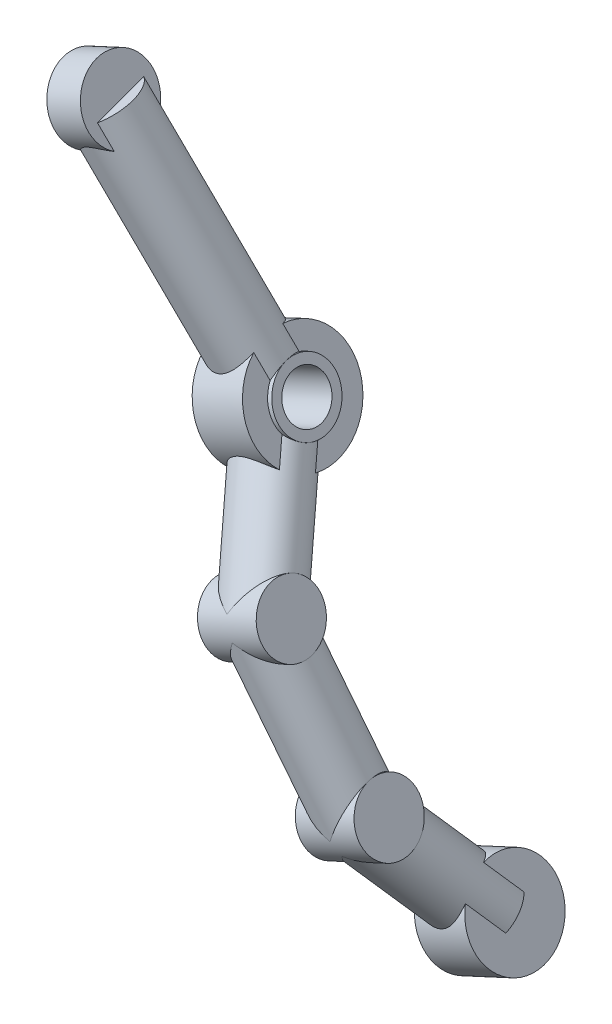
ISO-10303-21;
HEADER;
FILE_DESCRIPTION(('STEP AP214'),'2;1');
FILE_NAME('part.step','',(''),(''),'','','');
FILE_SCHEMA(('AUTOMOTIVE_DESIGN { 1 0 10303 214 1 1 1 1 }'));
ENDSEC;
DATA;
#1=APPLICATION_CONTEXT('core data for automotive mechanical design processes');
#2=APPLICATION_PROTOCOL_DEFINITION('international standard','automotive_design',2000,#1);
#3=PRODUCT_CONTEXT('',#1,'mechanical');
#4=PRODUCT('Part','Part','',(#3));
#5=PRODUCT_RELATED_PRODUCT_CATEGORY('part','',(#4));
#6=PRODUCT_DEFINITION_FORMATION('','',#4);
#7=PRODUCT_DEFINITION_CONTEXT('part definition',#1,'design');
#8=PRODUCT_DEFINITION('design','',#6,#7);
#9=PRODUCT_DEFINITION_SHAPE('','',#8);
#10=(LENGTH_UNIT() NAMED_UNIT(*) SI_UNIT(.MILLI.,.METRE.));
#11=(NAMED_UNIT(*) PLANE_ANGLE_UNIT() SI_UNIT($,.RADIAN.));
#12=(NAMED_UNIT(*) SI_UNIT($,.STERADIAN.) SOLID_ANGLE_UNIT());
#13=UNCERTAINTY_MEASURE_WITH_UNIT(LENGTH_MEASURE(1.E-05),#10,'distance_accuracy_value','');
#14=(GEOMETRIC_REPRESENTATION_CONTEXT(3) GLOBAL_UNCERTAINTY_ASSIGNED_CONTEXT((#13)) GLOBAL_UNIT_ASSIGNED_CONTEXT((#10,
#11,#12)) REPRESENTATION_CONTEXT('',''));
#15=CARTESIAN_POINT('',(0.,0.,0.));
#16=DIRECTION('',(0.,0.,1.));
#17=DIRECTION('',(1.,0.,0.));
#18=AXIS2_PLACEMENT_3D('',#15,#16,#17);
#19=CARTESIAN_POINT('',(455.341566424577,345.362620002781,22.));
#20=DIRECTION('',(0.336774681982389,-0.725660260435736,-0.600000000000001));
#21=DIRECTION('',(0.,0.637223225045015,-0.77067928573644));
#22=AXIS2_PLACEMENT_3D('',#19,#20,#21);
#23=PLANE('',#22);
#24=CARTESIAN_POINT('',(455.341566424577,345.362620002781,22.));
#25=DIRECTION('',(0.336774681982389,-0.725660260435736,-0.600000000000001));
#26=DIRECTION('',(0.,0.637223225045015,-0.77067928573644));
#27=AXIS2_PLACEMENT_3D('',#24,#25,#26);
#28=CIRCLE('',#27,3.50000000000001);
#29=CARTESIAN_POINT('',(453.075687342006,343.118562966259,23.4422205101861));
#30=VERTEX_POINT('',#29);
#31=CARTESIAN_POINT('',(452.164993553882,345.080866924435,20.5577794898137));
#32=VERTEX_POINT('',#31);
#33=EDGE_CURVE('E276',#30,#32,#28,.T.);
#34=ORIENTED_EDGE('',*,*,#33,.T.);
#35=DIRECTION('',(0.252581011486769,-0.544245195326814,0.799999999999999));
#36=VECTOR('',#35,1.);
#37=CARTESIAN_POINT('',(452.620340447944,344.099714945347,21.9999999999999));
#38=LINE('',#37,#36);
#39=EDGE_CURVE('E301',#32,#30,#38,.T.);
#40=ORIENTED_EDGE('',*,*,#39,.T.);
#41=EDGE_LOOP('',(#34,#40));
#42=FACE_BOUND('',#41,.T.);
#43=ADVANCED_FACE('F100',(#42),#23,.T.);
#44=CARTESIAN_POINT('',(450.289946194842,356.247523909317,31.));
#45=DIRECTION('',(0.336774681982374,-0.725660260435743,-0.600000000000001));
#46=DIRECTION('',(0.,0.637223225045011,-0.770679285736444));
#47=AXIS2_PLACEMENT_3D('',#44,#45,#46);
#48=CYLINDRICAL_SURFACE('',#47,3.50000000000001);
#49=CARTESIAN_POINT('',(450.289946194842,356.247523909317,31.));
#50=DIRECTION('',(0.879534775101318,-0.215449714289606,-0.42426406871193));
#51=DIRECTION('',(-0.403263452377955,-0.810788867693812,-0.424264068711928));
#52=AXIS2_PLACEMENT_3D('',#49,#50,#51);
#53=ELLIPSE('',#52,4.94974746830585,3.50000000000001);
#54=CARTESIAN_POINT('',(448.958208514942,357.147420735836,27.7822113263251));
#55=VERTEX_POINT('',#54);
#56=CARTESIAN_POINT('',(448.293893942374,352.234323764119,28.9));
#57=VERTEX_POINT('',#56);
#58=EDGE_CURVE('E514',#55,#57,#53,.F.);
#59=ORIENTED_EDGE('',*,*,#58,.F.);
#60=CARTESIAN_POINT('',(450.289946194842,356.247523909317,31.));
#61=DIRECTION('',(0.387024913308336,-0.833936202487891,-0.393398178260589));
#62=DIRECTION('',(0.165608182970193,-0.356841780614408,0.919368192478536));
#63=AXIS2_PLACEMENT_3D('',#60,#61,#62);
#64=ELLIPSE('',#63,3.60255219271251,3.50000000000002);
#65=CARTESIAN_POINT('',(450.46242659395,357.845519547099,27.7822113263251));
#66=VERTEX_POINT('',#65);
#67=EDGE_CURVE('E491',#55,#66,#64,.T.);
#68=ORIENTED_EDGE('',*,*,#67,.T.);
#69=CARTESIAN_POINT('',(450.289946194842,356.247523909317,31.));
#70=DIRECTION('',(-0.403263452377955,-0.810788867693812,-0.424264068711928));
#71=DIRECTION('',(0.879534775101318,-0.215449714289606,-0.42426406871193));
#72=AXIS2_PLACEMENT_3D('',#69,#70,#71);
#73=ELLIPSE('',#72,4.94974746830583,3.50000000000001);
#74=CARTESIAN_POINT('',(454.643421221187,355.181102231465,28.9));
#75=VERTEX_POINT('',#74);
#76=EDGE_CURVE('E507',#75,#66,#73,.F.);
#77=ORIENTED_EDGE('',*,*,#76,.F.);
#78=CARTESIAN_POINT('',(451.173979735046,354.342665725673,33.8));
#79=VERTEX_POINT('',#78);
#80=EDGE_CURVE('E510',#79,#75,#73,.F.);
#81=ORIENTED_EDGE('',*,*,#80,.F.);
#82=EDGE_CURVE('E511',#57,#79,#53,.F.);
#83=ORIENTED_EDGE('',*,*,#82,.F.);
#84=EDGE_LOOP('',(#59,#68,#77,#81,#83));
#85=FACE_BOUND('',#84,.T.);
#86=CARTESIAN_POINT('',(450.594380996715,348.465121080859,23.3559932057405));
#87=CARTESIAN_POINT('',(450.632576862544,348.511820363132,23.262758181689));
#88=CARTESIAN_POINT('',(450.67554446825,348.557084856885,23.1708172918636));
#89=CARTESIAN_POINT('',(450.770262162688,348.645066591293,22.9903806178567));
#90=CARTESIAN_POINT('',(450.82200674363,348.687785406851,22.9018827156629));
#91=CARTESIAN_POINT('',(450.933897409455,348.771302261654,22.7285584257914));
#92=CARTESIAN_POINT('',(450.994091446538,348.812087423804,22.6437568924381));
#93=CARTESIAN_POINT('',(451.122005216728,348.891957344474,22.479161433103));
#94=CARTESIAN_POINT('',(451.189726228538,348.931041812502,22.3993683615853));
#95=CARTESIAN_POINT('',(451.332017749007,349.008023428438,22.2457518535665));
#96=CARTESIAN_POINT('',(451.406577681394,349.045922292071,22.1719195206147));
#97=CARTESIAN_POINT('',(451.562054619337,349.121234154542,22.0310791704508));
#98=CARTESIAN_POINT('',(451.642972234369,349.158647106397,21.9640718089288));
#99=CARTESIAN_POINT('',(451.894135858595,349.271072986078,21.7752716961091));
#100=CARTESIAN_POINT('',(452.07337641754,349.346572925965,21.6650616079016));
#101=CARTESIAN_POINT('',(452.389193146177,349.479216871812,21.5162609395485));
#102=CARTESIAN_POINT('',(452.521095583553,349.534515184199,21.466038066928));
#103=CARTESIAN_POINT('',(452.789799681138,349.649545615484,21.3898051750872));
#104=CARTESIAN_POINT('',(452.926591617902,349.709269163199,21.3637496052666));
#105=CARTESIAN_POINT('',(453.201493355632,349.833228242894,21.3385991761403));
#106=CARTESIAN_POINT('',(453.339606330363,349.897484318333,21.3396361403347));
#107=CARTESIAN_POINT('',(453.611969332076,350.028075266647,21.3688613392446));
#108=CARTESIAN_POINT('',(453.746215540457,350.094412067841,21.3970755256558));
#109=CARTESIAN_POINT('',(454.029276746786,350.236646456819,21.4841844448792));
#110=CARTESIAN_POINT('',(454.176862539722,350.312324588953,21.5473576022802));
#111=CARTESIAN_POINT('',(454.461584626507,350.457141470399,21.699752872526));
#112=CARTESIAN_POINT('',(454.598692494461,350.526262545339,21.7890428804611));
#113=CARTESIAN_POINT('',(454.898965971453,350.671170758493,22.0149625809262));
#114=CARTESIAN_POINT('',(455.059011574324,350.743616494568,22.1578608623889));
#115=CARTESIAN_POINT('',(455.364188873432,350.863859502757,22.4674356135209));
#116=CARTESIAN_POINT('',(455.509343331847,350.91169485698,22.6340748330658));
#117=CARTESIAN_POINT('',(455.715893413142,350.96008702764,22.896659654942));
#118=CARTESIAN_POINT('',(455.782841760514,350.972323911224,22.9862327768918));
#119=CARTESIAN_POINT('',(455.912803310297,350.98823189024,23.1687503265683));
#120=CARTESIAN_POINT('',(455.975821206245,350.991913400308,23.2616905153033));
#121=CARTESIAN_POINT('',(456.036832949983,350.990931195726,23.3559932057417));
#122=B_SPLINE_CURVE_WITH_KNOTS('',3,(#86,#87,#88,#89,#90,#91,#92,#93,#94,#95,#96,#97,#98,#99,
#100,#101,#102,#103,#104,#105,#106,#107,#108,#109,#110,#111,#112,#113,#114,#115,#116,#117,#118,
#119,#120,#121),.UNSPECIFIED.,.F.,.F.,(4,2,2,2,2,2,2,2,2,2,2,2,2,2,2,2,2,4),(0.,
0.332966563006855,0.665724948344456,1.00045449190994,1.33524098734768,1.66951820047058,
2.00382749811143,2.66972985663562,3.12280153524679,3.57501751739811,4.02943424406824,
4.48428532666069,5.01385226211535,5.54480832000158,6.22088122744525,6.89590480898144,
7.23299855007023,7.56968172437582),.UNSPECIFIED.);
#123=CARTESIAN_POINT('',(450.594380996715,348.465121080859,23.3559932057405));
#124=VERTEX_POINT('',#123);
#125=CARTESIAN_POINT('',(456.036832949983,350.990931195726,23.3559932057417));
#126=VERTEX_POINT('',#125);
#127=EDGE_CURVE('E118',#124,#126,#122,.T.);
#128=ORIENTED_EDGE('',*,*,#127,.F.);
#129=DIRECTION('',(0.336774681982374,-0.725660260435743,-0.600000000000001));
#130=VECTOR('',#129,1.);
#131=CARTESIAN_POINT('',(447.113373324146,355.965770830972,29.5577794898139));
#132=LINE('',#131,#130);
#133=EDGE_CURVE('E12',#124,#32,#132,.T.);
#134=ORIENTED_EDGE('',*,*,#133,.T.);
#135=ORIENTED_EDGE('',*,*,#33,.F.);
#136=DIRECTION('',(0.336774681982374,-0.725660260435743,-0.600000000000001));
#137=VECTOR('',#136,1.);
#138=CARTESIAN_POINT('',(448.02406711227,354.003466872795,32.4422205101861));
#139=LINE('',#138,#137);
#140=CARTESIAN_POINT('',(451.505074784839,346.502817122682,26.2404342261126));
#141=VERTEX_POINT('',#140);
#142=EDGE_CURVE('E270',#30,#141,#139,.F.);
#143=ORIENTED_EDGE('',*,*,#142,.T.);
#144=CARTESIAN_POINT('',(456.947526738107,349.028627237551,26.2404342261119));
#145=CARTESIAN_POINT('',(456.93284892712,348.931252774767,26.2917693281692));
#146=CARTESIAN_POINT('',(456.914660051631,348.832596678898,26.3395642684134));
#147=CARTESIAN_POINT('',(456.87134473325,348.633856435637,26.428422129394));
#148=CARTESIAN_POINT('',(456.846222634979,348.533773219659,26.4694892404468));
#149=CARTESIAN_POINT('',(456.788937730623,348.332595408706,26.5455275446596));
#150=CARTESIAN_POINT('',(456.756734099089,348.231498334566,26.5804611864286));
#151=CARTESIAN_POINT('',(456.685315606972,348.029896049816,26.6444042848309));
#152=CARTESIAN_POINT('',(456.646099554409,347.929390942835,26.6734127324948));
#153=CARTESIAN_POINT('',(456.560539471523,347.730168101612,26.7259561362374));
#154=CARTESIAN_POINT('',(456.514206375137,347.631447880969,26.7494993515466));
#155=CARTESIAN_POINT('',(456.414104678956,347.436817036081,26.7916828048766));
#156=CARTESIAN_POINT('',(456.360335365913,347.340906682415,26.8103225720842));
#157=CARTESIAN_POINT('',(456.187493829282,347.059717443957,26.8595835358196));
#158=CARTESIAN_POINT('',(456.056548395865,346.880154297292,26.883750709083));
#159=CARTESIAN_POINT('',(455.807672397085,346.603270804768,26.9132893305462));
#160=CARTESIAN_POINT('',(455.698958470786,346.498007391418,26.9221993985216));
#161=CARTESIAN_POINT('',(455.465790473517,346.306406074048,26.9351209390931));
#162=CARTESIAN_POINT('',(455.341366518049,346.220032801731,26.9391416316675));
#163=CARTESIAN_POINT('',(455.0783987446,346.070359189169,26.9430304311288));
#164=CARTESIAN_POINT('',(454.939789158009,346.007173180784,26.9428782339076));
#165=CARTESIAN_POINT('',(454.653568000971,345.906442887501,26.9383428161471));
#166=CARTESIAN_POINT('',(454.505947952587,345.868923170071,26.9339555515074));
#167=CARTESIAN_POINT('',(454.182371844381,345.813987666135,26.9190282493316));
#168=CARTESIAN_POINT('',(454.005744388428,345.800886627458,26.90759591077));
#169=CARTESIAN_POINT('',(453.653237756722,345.802127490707,26.8759660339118));
#170=CARTESIAN_POINT('',(453.477361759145,345.816541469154,26.8557455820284));
#171=CARTESIAN_POINT('',(453.083073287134,345.874210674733,26.7973236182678));
#172=CARTESIAN_POINT('',(452.866172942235,345.924271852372,26.7557181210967));
#173=CARTESIAN_POINT('',(452.44634108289,346.051079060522,26.650412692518));
#174=CARTESIAN_POINT('',(452.243388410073,346.127783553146,26.5867471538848));
#175=CARTESIAN_POINT('',(451.953920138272,346.25805812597,26.4718899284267));
#176=CARTESIAN_POINT('',(451.859977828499,346.303986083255,26.4304094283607));
#177=CARTESIAN_POINT('',(451.67795996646,346.400245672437,26.3406357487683));
#178=CARTESIAN_POINT('',(451.589877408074,346.450571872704,26.2923509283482));
#179=CARTESIAN_POINT('',(451.505074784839,346.502817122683,26.2404342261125));
#180=B_SPLINE_CURVE_WITH_KNOTS('',3,(#144,#145,#146,#147,#148,#149,#150,#151,#152,#153,#154,
#155,#156,#157,#158,#159,#160,#161,#162,#163,#164,#165,#166,#167,#168,#169,#170,#171,#172,#173,
#174,#175,#176,#177,#178,#179),.UNSPECIFIED.,.F.,.F.,(4,2,2,2,2,2,2,2,2,2,2,2,2,2,2,2,2,4),(0.,
0.332966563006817,0.665724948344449,1.0004544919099,1.33524098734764,1.66951820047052,
2.00382749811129,2.66972985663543,3.12280153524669,3.57501751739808,4.02943424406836,
4.48428532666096,5.01385226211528,5.54480832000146,6.22088122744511,6.8959048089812,
7.23299855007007,7.56968172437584),.UNSPECIFIED.);
#181=CARTESIAN_POINT('',(456.947526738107,349.028627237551,26.2404342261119));
#182=VERTEX_POINT('',#181);
#183=EDGE_CURVE('E273',#182,#141,#180,.T.);
#184=ORIENTED_EDGE('',*,*,#183,.F.);
#185=DIRECTION('',(0.336774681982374,-0.725660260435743,-0.600000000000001));
#186=VECTOR('',#185,1.);
#187=CARTESIAN_POINT('',(453.466519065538,356.529276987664,32.442220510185));
#188=LINE('',#187,#186);
#189=CARTESIAN_POINT('',(458.518139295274,345.644373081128,23.442220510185));
#190=VERTEX_POINT('',#189);
#191=EDGE_CURVE('E280',#190,#182,#188,.F.);
#192=ORIENTED_EDGE('',*,*,#191,.F.);
#193=CARTESIAN_POINT('',(457.60744550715,347.606677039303,20.5577794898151));
#194=VERTEX_POINT('',#193);
#195=EDGE_CURVE('E482',#194,#190,#28,.T.);
#196=ORIENTED_EDGE('',*,*,#195,.F.);
#197=DIRECTION('',(0.336774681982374,-0.725660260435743,-0.600000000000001));
#198=VECTOR('',#197,1.);
#199=CARTESIAN_POINT('',(452.555825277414,358.491580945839,29.557779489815));
#200=LINE('',#199,#198);
#201=EDGE_CURVE('E109',#126,#194,#200,.T.);
#202=ORIENTED_EDGE('',*,*,#201,.F.);
#203=EDGE_LOOP('',(#128,#134,#135,#143,#184,#192,#196,#202));
#204=FACE_BOUND('',#203,.T.);
#205=ADVANCED_FACE('F272',(#85,#204),#48,.T.);
#206=CARTESIAN_POINT('',(424.610876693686,411.579118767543,33.));
#207=DIRECTION('',(0.408399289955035,-0.879992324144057,-0.242535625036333));
#208=DIRECTION('',(0.90707532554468,0.420968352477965,0.));
#209=AXIS2_PLACEMENT_3D('',#206,#207,#208);
#210=CYLINDRICAL_SURFACE('',#209,3.49999999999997);
#211=CARTESIAN_POINT('',(431.155529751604,390.350698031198,25.6390242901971));
#212=CARTESIAN_POINT('',(431.205918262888,390.367963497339,25.5467728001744));
#213=CARTESIAN_POINT('',(431.260484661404,390.384939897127,25.4567871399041));
#214=CARTESIAN_POINT('',(431.377248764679,390.418748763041,25.2819265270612));
#215=CARTESIAN_POINT('',(431.439443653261,390.435581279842,25.197049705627));
#216=CARTESIAN_POINT('',(431.571038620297,390.469615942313,25.0325918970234));
#217=CARTESIAN_POINT('',(431.640466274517,390.486819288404,24.9530332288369));
#218=CARTESIAN_POINT('',(431.785623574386,390.52205441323,24.800116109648));
#219=CARTESIAN_POINT('',(431.861353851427,390.540086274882,24.7267582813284));
#220=CARTESIAN_POINT('',(432.096953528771,390.596259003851,24.5168435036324));
#221=CARTESIAN_POINT('',(432.265405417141,390.636518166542,24.3902297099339));
#222=CARTESIAN_POINT('',(432.61919780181,390.727720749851,24.1689896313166));
#223=CARTESIAN_POINT('',(432.804500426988,390.778640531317,24.0742937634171));
#224=CARTESIAN_POINT('',(433.144450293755,390.883539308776,23.9387636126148));
#225=CARTESIAN_POINT('',(433.297142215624,390.934516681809,23.8907316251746));
#226=CARTESIAN_POINT('',(433.604343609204,391.047529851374,23.8206470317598));
#227=CARTESIAN_POINT('',(433.758850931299,391.109553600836,23.7985663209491));
#228=CARTESIAN_POINT('',(434.065106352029,391.244419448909,23.7819229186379));
#229=CARTESIAN_POINT('',(434.216846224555,391.317289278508,23.7874319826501));
#230=CARTESIAN_POINT('',(434.512610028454,391.471117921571,23.8257058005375));
#231=CARTESIAN_POINT('',(434.656629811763,391.552081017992,23.8584850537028));
#232=CARTESIAN_POINT('',(434.929952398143,391.715608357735,23.947737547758));
#233=CARTESIAN_POINT('',(435.059559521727,391.798059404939,24.0035015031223));
#234=CARTESIAN_POINT('',(435.307714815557,391.962825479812,24.1359177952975));
#235=CARTESIAN_POINT('',(435.426255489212,392.0451403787,24.2125841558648));
#236=CARTESIAN_POINT('',(435.669734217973,392.2184577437,24.3976034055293));
#237=CARTESIAN_POINT('',(435.792789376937,392.30881443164,24.509032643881));
#238=CARTESIAN_POINT('',(436.024159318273,392.479206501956,24.7529505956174));
#239=CARTESIAN_POINT('',(436.132480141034,392.559246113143,24.8854306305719));
#240=CARTESIAN_POINT('',(436.300893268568,392.680181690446,25.1215089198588));
#241=CARTESIAN_POINT('',(436.365064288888,392.725254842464,25.2201094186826));
#242=CARTESIAN_POINT('',(436.486618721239,392.807279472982,25.4244236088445));
#243=CARTESIAN_POINT('',(436.544009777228,392.844240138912,25.5301290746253));
#244=CARTESIAN_POINT('',(436.597981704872,392.876508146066,25.639024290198));
#245=B_SPLINE_CURVE_WITH_KNOTS('',3,(#211,#212,#213,#214,#215,#216,#217,#218,#219,#220,#221,
#222,#223,#224,#225,#226,#227,#228,#229,#230,#231,#232,#233,#234,#235,#236,#237,#238,#239,#240,
#241,#242,#243,#244),.UNSPECIFIED.,.F.,.F.,(4,2,2,2,2,2,2,2,2,2,2,2,2,2,2,2,4),(0.,
0.319418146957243,0.638718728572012,0.9592846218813,1.27988266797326,1.92024942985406,
2.5592109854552,3.06104886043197,3.56234275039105,4.06494108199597,4.56780681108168,
5.05619570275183,5.54491307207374,6.10980771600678,6.6744700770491,7.0518172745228,
7.42873489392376),.UNSPECIFIED.);
#246=CARTESIAN_POINT('',(431.155529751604,390.350698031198,25.6390242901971));
#247=VERTEX_POINT('',#246);
#248=CARTESIAN_POINT('',(436.597981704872,392.876508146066,25.639024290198));
#249=VERTEX_POINT('',#248);
#250=EDGE_CURVE('E360',#247,#249,#245,.T.);
#251=ORIENTED_EDGE('',*,*,#250,.F.);
#252=DIRECTION('',(0.408399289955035,-0.879992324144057,-0.242535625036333));
#253=VECTOR('',#252,1.);
#254=CARTESIAN_POINT('',(421.705587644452,410.712820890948,31.2510507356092));
#255=LINE('',#254,#253);
#256=CARTESIAN_POINT('',(432.26750364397,387.954688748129,24.9786576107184));
#257=VERTEX_POINT('',#256);
#258=EDGE_CURVE('E344',#247,#257,#255,.T.);
#259=ORIENTED_EDGE('',*,*,#258,.T.);
#260=CARTESIAN_POINT('',(436.397990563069,386.181009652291,26.));
#261=DIRECTION('',(-0.352617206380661,-0.919918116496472,-0.171498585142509));
#262=DIRECTION('',(0.930181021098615,-0.324578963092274,-0.171498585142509));
#263=AXIS2_PLACEMENT_3D('',#260,#261,#262);
#264=ELLIPSE('',#263,4.9497474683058,3.49999999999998);
#265=CARTESIAN_POINT('',(431.79382940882,387.787593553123,26.8488746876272));
#266=VERTEX_POINT('',#265);
#267=EDGE_CURVE('E537',#266,#257,#264,.T.);
#268=ORIENTED_EDGE('',*,*,#267,.F.);
#269=CARTESIAN_POINT('',(432.635629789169,387.16147438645,28.4765561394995));
#270=VERTEX_POINT('',#269);
#271=EDGE_CURVE('E543',#270,#266,#264,.T.);
#272=ORIENTED_EDGE('',*,*,#271,.F.);
#273=DIRECTION('',(0.408399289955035,-0.879992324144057,-0.242535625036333));
#274=VECTOR('',#273,1.);
#275=CARTESIAN_POINT('',(422.073713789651,409.919606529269,34.7489492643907));
#276=LINE('',#275,#274);
#277=CARTESIAN_POINT('',(431.523655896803,389.557483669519,29.1369228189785));
#278=VERTEX_POINT('',#277);
#279=EDGE_CURVE('E350',#270,#278,#276,.F.);
#280=ORIENTED_EDGE('',*,*,#279,.T.);
#281=CARTESIAN_POINT('',(436.966107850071,392.083293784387,29.1369228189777));
#282=CARTESIAN_POINT('',(436.938393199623,392.01717215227,29.215709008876));
#283=CARTESIAN_POINT('',(436.90765322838,391.948856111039,29.291544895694));
#284=CARTESIAN_POINT('',(436.840178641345,391.808841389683,29.4371339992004));
#285=CARTESIAN_POINT('',(436.803446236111,391.73714396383,29.5068894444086));
#286=CARTESIAN_POINT('',(436.723864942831,391.591033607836,29.6404579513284));
#287=CARTESIAN_POINT('',(436.680992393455,391.516611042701,29.7042463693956));
#288=CARTESIAN_POINT('',(436.589223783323,391.366337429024,29.825457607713));
#289=CARTESIAN_POINT('',(436.54032711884,391.290486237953,29.8828797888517));
#290=CARTESIAN_POINT('',(436.384527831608,391.062364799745,30.0454035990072));
#291=CARTESIAN_POINT('',(436.2684133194,390.909332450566,30.1409358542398));
#292=CARTESIAN_POINT('',(436.010912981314,390.610646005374,30.3049910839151));
#293=CARTESIAN_POINT('',(435.869583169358,390.464976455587,30.3735728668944));
#294=CARTESIAN_POINT('',(435.594483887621,390.220341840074,30.4705902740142));
#295=CARTESIAN_POINT('',(435.465600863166,390.118062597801,30.5044828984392));
#296=CARTESIAN_POINT('',(435.193528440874,389.929355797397,30.5537054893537));
#297=CARTESIAN_POINT('',(435.050354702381,389.842911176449,30.5690555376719));
#298=CARTESIAN_POINT('',(434.752618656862,389.68968833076,30.5806395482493));
#299=CARTESIAN_POINT('',(434.598027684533,389.622961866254,30.5768236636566));
#300=CARTESIAN_POINT('',(434.282774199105,389.511128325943,30.5501241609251));
#301=CARTESIAN_POINT('',(434.122108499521,389.466032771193,30.5272303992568));
#302=CARTESIAN_POINT('',(433.804740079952,389.397412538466,30.4641353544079));
#303=CARTESIAN_POINT('',(433.648056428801,389.373304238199,30.4244513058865));
#304=CARTESIAN_POINT('',(433.338018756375,389.341878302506,30.3287850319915));
#305=CARTESIAN_POINT('',(433.184667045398,389.334571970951,30.2727918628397));
#306=CARTESIAN_POINT('',(432.861178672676,389.333654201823,30.1352878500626));
#307=CARTESIAN_POINT('',(432.692151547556,389.342354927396,30.0511599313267));
#308=CARTESIAN_POINT('',(432.367167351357,389.373676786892,29.8628365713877));
#309=CARTESIAN_POINT('',(432.211204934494,389.396292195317,29.758649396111));
#310=CARTESIAN_POINT('',(431.965277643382,389.442379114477,29.5686043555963));
#311=CARTESIAN_POINT('',(431.870582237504,389.463077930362,29.4881313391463));
#312=CARTESIAN_POINT('',(431.690143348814,389.50793371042,29.3187867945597));
#313=CARTESIAN_POINT('',(431.604389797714,389.532086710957,29.229924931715));
#314=CARTESIAN_POINT('',(431.523655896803,389.557483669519,29.1369228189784));
#315=B_SPLINE_CURVE_WITH_KNOTS('',3,(#281,#282,#283,#284,#285,#286,#287,#288,#289,#290,#291,
#292,#293,#294,#295,#296,#297,#298,#299,#300,#301,#302,#303,#304,#305,#306,#307,#308,#309,#310,
#311,#312,#313,#314),.UNSPECIFIED.,.F.,.F.,(4,2,2,2,2,2,2,2,2,2,2,2,2,2,2,2,4),(0.,
0.319418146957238,0.638718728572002,0.959284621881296,1.27988266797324,1.92024942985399,
2.55921098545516,3.06104886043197,3.56234275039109,4.06494108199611,4.56780681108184,
5.05619570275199,5.5449130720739,6.10980771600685,6.67447007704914,7.05181727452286,
7.42873489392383),.UNSPECIFIED.);
#316=CARTESIAN_POINT('',(436.966107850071,392.083293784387,29.1369228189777));
#317=VERTEX_POINT('',#316);
#318=EDGE_CURVE('E352',#317,#278,#315,.T.);
#319=ORIENTED_EDGE('',*,*,#318,.F.);
#320=DIRECTION('',(0.408399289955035,-0.879992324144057,-0.242535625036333));
#321=VECTOR('',#320,1.);
#322=CARTESIAN_POINT('',(427.51616574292,412.445416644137,34.7489492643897));
#323=LINE('',#322,#321);
#324=CARTESIAN_POINT('',(438.078081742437,389.687284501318,28.4765561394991));
#325=VERTEX_POINT('',#324);
#326=EDGE_CURVE('E330',#325,#317,#323,.F.);
#327=ORIENTED_EDGE('',*,*,#326,.F.);
#328=CARTESIAN_POINT('',(436.397990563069,386.181009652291,26.));
#329=DIRECTION('',(0.930181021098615,-0.324578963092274,-0.171498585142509));
#330=DIRECTION('',(-0.352617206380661,-0.919918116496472,-0.171498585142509));
#331=AXIS2_PLACEMENT_3D('',#328,#329,#330);
#332=ELLIPSE('',#331,4.94974746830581,3.49999999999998);
#333=CARTESIAN_POINT('',(438.143356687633,390.734372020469,26.8488746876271));
#334=VERTEX_POINT('',#333);
#335=EDGE_CURVE('E545',#334,#325,#332,.T.);
#336=ORIENTED_EDGE('',*,*,#335,.F.);
#337=CARTESIAN_POINT('',(437.709955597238,390.480498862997,24.978657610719));
#338=VERTEX_POINT('',#337);
#339=EDGE_CURVE('E544',#338,#334,#332,.T.);
#340=ORIENTED_EDGE('',*,*,#339,.F.);
#341=DIRECTION('',(0.408399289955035,-0.879992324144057,-0.242535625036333));
#342=VECTOR('',#341,1.);
#343=CARTESIAN_POINT('',(427.148039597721,413.238631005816,31.2510507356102));
#344=LINE('',#343,#342);
#345=EDGE_CURVE('E339',#249,#338,#344,.T.);
#346=ORIENTED_EDGE('',*,*,#345,.F.);
#347=EDGE_LOOP('',(#251,#259,#268,#272,#280,#319,#327,#336,#340,#346));
#348=FACE_BOUND('',#347,.T.);
#349=CARTESIAN_POINT('',(424.226920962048,407.655490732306,35.1113315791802));
#350=CARTESIAN_POINT('',(424.273796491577,407.717037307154,35.1694417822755));
#351=CARTESIAN_POINT('',(424.321901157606,407.779874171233,35.2252178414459));
#352=CARTESIAN_POINT('',(424.421202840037,407.90749157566,35.3319127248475));
#353=CARTESIAN_POINT('',(424.47240583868,407.972275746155,35.3828216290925));
#354=CARTESIAN_POINT('',(424.579431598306,408.104225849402,35.4803394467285));
#355=CARTESIAN_POINT('',(424.635327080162,408.171413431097,35.5268399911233));
#356=CARTESIAN_POINT('',(424.751611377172,408.305734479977,35.6137518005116));
#357=CARTESIAN_POINT('',(424.811996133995,408.372867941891,35.6541684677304));
#358=CARTESIAN_POINT('',(424.951896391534,408.519887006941,35.7360463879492));
#359=CARTESIAN_POINT('',(425.032744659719,408.599437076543,35.7758903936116));
#360=CARTESIAN_POINT('',(425.204462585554,408.752086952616,35.8429640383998));
#361=CARTESIAN_POINT('',(425.295269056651,408.825222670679,35.8702680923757));
#362=CARTESIAN_POINT('',(425.471619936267,408.948466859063,35.9062129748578));
#363=CARTESIAN_POINT('',(425.55538758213,409.000372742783,35.9172544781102));
#364=CARTESIAN_POINT('',(425.729430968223,409.09331011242,35.9275716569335));
#365=CARTESIAN_POINT('',(425.819702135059,409.13434914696,35.9268555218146));
#366=CARTESIAN_POINT('',(426.003608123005,409.204316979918,35.9137901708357));
#367=CARTESIAN_POINT('',(426.097231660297,409.233282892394,35.9014769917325));
#368=CARTESIAN_POINT('',(426.28534221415,409.280598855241,35.8666138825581));
#369=CARTESIAN_POINT('',(426.379830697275,409.298924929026,35.8440410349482));
#370=CARTESIAN_POINT('',(426.55569466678,409.325513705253,35.7937277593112));
#371=CARTESIAN_POINT('',(426.637226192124,409.334751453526,35.7669928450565));
#372=CARTESIAN_POINT('',(426.798645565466,409.348524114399,35.7079044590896));
#373=CARTESIAN_POINT('',(426.878532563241,409.353056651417,35.6755481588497));
#374=CARTESIAN_POINT('',(427.03643967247,409.358773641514,35.6058196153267));
#375=CARTESIAN_POINT('',(427.114454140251,409.359948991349,35.5684340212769));
#376=CARTESIAN_POINT('',(427.268131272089,409.360000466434,35.4892068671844));
#377=CARTESIAN_POINT('',(427.343794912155,409.358877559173,35.4473671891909));
#378=CARTESIAN_POINT('',(427.493976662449,409.355142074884,35.3587517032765));
#379=CARTESIAN_POINT('',(427.568449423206,409.35250296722,35.311900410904));
#380=CARTESIAN_POINT('',(427.714162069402,409.346392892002,35.2144294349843));
#381=CARTESIAN_POINT('',(427.785419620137,409.342927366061,35.163835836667));
#382=CARTESIAN_POINT('',(427.855222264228,409.339364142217,35.1113315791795));
#383=B_SPLINE_CURVE_WITH_KNOTS('',3,(#349,#350,#351,#352,#353,#354,#355,#356,#357,#358,#359,
#360,#361,#362,#363,#364,#365,#366,#367,#368,#369,#370,#371,#372,#373,#374,#375,#376,#377,#378,
#379,#380,#381,#382),.UNSPECIFIED.,.F.,.F.,(4,2,2,2,2,2,2,2,2,2,2,2,2,2,2,2,4),(0.,
0.290250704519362,0.581080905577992,0.877819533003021,1.17429309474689,1.53402688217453,
1.89159743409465,2.18772895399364,2.48365422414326,2.7786629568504,3.07433392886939,
3.33285850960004,3.59151355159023,3.85086929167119,4.11011587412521,4.37404327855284,
4.6362786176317),.UNSPECIFIED.);
#384=CARTESIAN_POINT('',(424.226920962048,407.655490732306,35.1113315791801));
#385=VERTEX_POINT('',#384);
#386=CARTESIAN_POINT('',(427.855222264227,409.339364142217,35.1113315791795));
#387=VERTEX_POINT('',#386);
#388=EDGE_CURVE('E289',#385,#387,#383,.T.);
#389=ORIENTED_EDGE('',*,*,#388,.F.);
#390=DIRECTION('',(0.408399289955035,-0.879992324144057,-0.242535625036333));
#391=VECTOR('',#390,1.);
#392=CARTESIAN_POINT('',(423.08998545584,410.105285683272,35.786522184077));
#393=LINE('',#392,#391);
#394=CARTESIAN_POINT('',(423.08998545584,410.105285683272,35.7865221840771));
#395=VERTEX_POINT('',#394);
#396=EDGE_CURVE('E316',#385,#395,#393,.F.);
#397=ORIENTED_EDGE('',*,*,#396,.T.);
#398=CARTESIAN_POINT('',(424.610876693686,411.579118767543,33.));
#399=DIRECTION('',(0.408399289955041,-0.879992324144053,-0.242535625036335));
#400=DIRECTION('',(0.907075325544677,0.420968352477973,0.));
#401=AXIS2_PLACEMENT_3D('',#398,#399,#400);
#402=CIRCLE('',#401,3.49999999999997);
#403=CARTESIAN_POINT('',(422.503466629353,411.369078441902,30.2134778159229));
#404=VERTEX_POINT('',#403);
#405=EDGE_CURVE('E481',#395,#404,#402,.T.);
#406=ORIENTED_EDGE('',*,*,#405,.T.);
#407=DIRECTION('',(0.408399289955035,-0.879992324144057,-0.242535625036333));
#408=VECTOR('',#407,1.);
#409=CARTESIAN_POINT('',(422.503466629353,411.369078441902,30.2134778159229));
#410=LINE('',#409,#408);
#411=CARTESIAN_POINT('',(423.640402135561,408.919283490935,29.5382872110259));
#412=VERTEX_POINT('',#411);
#413=EDGE_CURVE('E313',#404,#412,#410,.T.);
#414=ORIENTED_EDGE('',*,*,#413,.T.);
#415=CARTESIAN_POINT('',(427.268703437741,410.603156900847,29.5382872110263));
#416=CARTESIAN_POINT('',(427.181714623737,410.628043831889,29.503999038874));
#417=CARTESIAN_POINT('',(427.093441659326,410.651759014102,29.4720776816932));
#418=CARTESIAN_POINT('',(426.914400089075,410.695959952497,29.4127378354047));
#419=CARTESIAN_POINT('',(426.823626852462,410.716439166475,29.3853284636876));
#420=CARTESIAN_POINT('',(426.638141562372,410.753548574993,29.3344053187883));
#421=CARTESIAN_POINT('',(426.543386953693,410.770092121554,29.310982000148));
#422=CARTESIAN_POINT('',(426.352128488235,410.79732055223,29.2685950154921));
#423=CARTESIAN_POINT('',(426.255626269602,410.808010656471,29.249627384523));
#424=CARTESIAN_POINT('',(426.04049984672,410.823084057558,29.2124239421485));
#425=CARTESIAN_POINT('',(425.921549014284,410.82563492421,29.1952078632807));
#426=CARTESIAN_POINT('',(425.68410413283,410.814609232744,29.1671674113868));
#427=CARTESIAN_POINT('',(425.565611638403,410.801129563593,29.1563052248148));
#428=CARTESIAN_POINT('',(425.35238207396,410.757349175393,29.142261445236));
#429=CARTESIAN_POINT('',(425.257061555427,410.730336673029,29.1380808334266));
#430=CARTESIAN_POINT('',(425.072230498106,410.660643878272,29.1341701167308));
#431=CARTESIAN_POINT('',(424.982715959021,410.617974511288,29.1344369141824));
#432=CARTESIAN_POINT('',(424.812454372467,410.518606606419,29.1393992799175));
#433=CARTESIAN_POINT('',(424.73168102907,410.461951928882,29.1440811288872));
#434=CARTESIAN_POINT('',(424.579217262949,410.337826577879,29.1577747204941));
#435=CARTESIAN_POINT('',(424.507547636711,410.270331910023,29.1667961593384));
#436=CARTESIAN_POINT('',(424.381204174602,410.137039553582,29.1877007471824));
#437=CARTESIAN_POINT('',(424.325526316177,410.072093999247,29.1990819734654));
#438=CARTESIAN_POINT('',(424.219759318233,409.938405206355,29.225120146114));
#439=CARTESIAN_POINT('',(424.16967301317,409.869660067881,29.2397787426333));
#440=CARTESIAN_POINT('',(424.074144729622,409.729533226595,29.2724624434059));
#441=CARTESIAN_POINT('',(424.028715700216,409.658144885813,29.2904965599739));
#442=CARTESIAN_POINT('',(423.941960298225,409.513894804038,29.3299809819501));
#443=CARTESIAN_POINT('',(423.900632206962,409.441033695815,29.3514298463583));
#444=CARTESIAN_POINT('',(423.820788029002,409.293210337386,29.3982740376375));
#445=CARTESIAN_POINT('',(423.782336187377,409.218233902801,29.4237336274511));
#446=CARTESIAN_POINT('',(423.708931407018,409.068539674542,29.4782632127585));
#447=CARTESIAN_POINT('',(423.673957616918,408.993823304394,29.5073090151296));
#448=CARTESIAN_POINT('',(423.640402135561,408.919283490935,29.5382872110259));
#449=B_SPLINE_CURVE_WITH_KNOTS('',3,(#415,#416,#417,#418,#419,#420,#421,#422,#423,#424,#425,
#426,#427,#428,#429,#430,#431,#432,#433,#434,#435,#436,#437,#438,#439,#440,#441,#442,#443,#444,
#445,#446,#447,#448),.UNSPECIFIED.,.F.,.F.,(4,2,2,2,2,2,2,2,2,2,2,2,2,2,2,2,4),(0.,
0.290250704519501,0.581080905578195,0.877819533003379,1.17429309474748,1.53402688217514,
1.89159743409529,2.18772895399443,2.483654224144,2.77866295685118,3.07433392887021,
3.3328585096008,3.591513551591,3.85086929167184,4.11011587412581,4.37404327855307,
4.63627861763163),.UNSPECIFIED.);
#450=CARTESIAN_POINT('',(427.26870343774,410.603156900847,29.5382872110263));
#451=VERTEX_POINT('',#450);
#452=EDGE_CURVE('E456',#451,#412,#449,.T.);
#453=ORIENTED_EDGE('',*,*,#452,.F.);
#454=DIRECTION('',(0.408399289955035,-0.879992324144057,-0.242535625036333));
#455=VECTOR('',#454,1.);
#456=CARTESIAN_POINT('',(426.131767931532,413.052951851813,30.2134778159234));
#457=LINE('',#456,#455);
#458=CARTESIAN_POINT('',(426.131767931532,413.052951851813,30.2134778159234));
#459=VERTEX_POINT('',#458);
#460=EDGE_CURVE('E309',#459,#451,#457,.T.);
#461=ORIENTED_EDGE('',*,*,#460,.F.);
#462=CARTESIAN_POINT('',(426.718286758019,411.789159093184,35.7865221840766));
#463=VERTEX_POINT('',#462);
#464=EDGE_CURVE('E476',#459,#463,#402,.T.);
#465=ORIENTED_EDGE('',*,*,#464,.T.);
#466=DIRECTION('',(0.408399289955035,-0.879992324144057,-0.242535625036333));
#467=VECTOR('',#466,1.);
#468=CARTESIAN_POINT('',(426.718286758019,411.789159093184,35.7865221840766));
#469=LINE('',#468,#467);
#470=EDGE_CURVE('E311',#387,#463,#469,.F.);
#471=ORIENTED_EDGE('',*,*,#470,.F.);
#472=EDGE_LOOP('',(#389,#397,#406,#414,#453,#461,#465,#471));
#473=FACE_BOUND('',#472,.T.);
#474=ADVANCED_FACE('F366',(#348,#473),#210,.T.);
#475=CARTESIAN_POINT('',(424.610876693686,411.579118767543,33.));
#476=DIRECTION('',(0.408399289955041,-0.879992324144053,-0.242535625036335));
#477=DIRECTION('',(0.907075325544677,0.420968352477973,0.));
#478=AXIS2_PLACEMENT_3D('',#475,#476,#477);
#479=PLANE('',#478);
#480=DIRECTION('',(0.102099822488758,-0.219998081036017,0.970142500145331));
#481=VECTOR('',#480,1.);
#482=CARTESIAN_POINT('',(422.796726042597,410.737182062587,33.));
#483=LINE('',#482,#481);
#484=EDGE_CURVE('E467',#404,#395,#483,.T.);
#485=ORIENTED_EDGE('',*,*,#484,.F.);
#486=ORIENTED_EDGE('',*,*,#405,.F.);
#487=EDGE_LOOP('',(#485,#486));
#488=FACE_BOUND('',#487,.T.);
#489=ADVANCED_FACE('F405',(#488),#479,.F.);
#490=CARTESIAN_POINT('',(436.397990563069,386.181009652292,26.));
#491=DIRECTION('',(0.371442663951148,-0.800360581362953,0.470588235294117));
#492=DIRECTION('',(0.,-0.506850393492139,-0.862034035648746));
#493=AXIS2_PLACEMENT_3D('',#490,#491,#492);
#494=CYLINDRICAL_SURFACE('',#493,3.49999999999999);
#495=CARTESIAN_POINT('',(442.712515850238,372.574879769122,34.));
#496=DIRECTION('',(0.90404874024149,-0.268270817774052,0.332756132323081));
#497=DIRECTION('',(-0.378749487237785,-0.863609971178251,0.332756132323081));
#498=AXIS2_PLACEMENT_3D('',#495,#496,#497);
#499=ELLIPSE('',#498,4.94974746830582,3.49999999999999);
#500=CARTESIAN_POINT('',(443.972157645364,372.535577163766,30.5460551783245));
#501=VERTEX_POINT('',#500);
#502=CARTESIAN_POINT('',(444.587230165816,376.849531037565,32.3529411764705));
#503=VERTEX_POINT('',#502);
#504=EDGE_CURVE('E558',#501,#503,#499,.T.);
#505=ORIENTED_EDGE('',*,*,#504,.F.);
#506=CARTESIAN_POINT('',(442.712515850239,372.574879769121,34.));
#507=DIRECTION('',(0.415428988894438,-0.895139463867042,0.16169135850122));
#508=DIRECTION('',(-0.0680669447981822,0.146666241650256,0.986841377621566));
#509=AXIS2_PLACEMENT_3D('',#506,#507,#508);
#510=ELLIPSE('',#509,3.69653577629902,3.50000000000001);
#511=CARTESIAN_POINT('',(441.9293426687,371.587518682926,30.5460551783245));
#512=VERTEX_POINT('',#511);
#513=EDGE_CURVE('E485',#512,#501,#510,.T.);
#514=ORIENTED_EDGE('',*,*,#513,.F.);
#515=CARTESIAN_POINT('',(442.712515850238,372.574879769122,34.));
#516=DIRECTION('',(-0.378749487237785,-0.863609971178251,0.332756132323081));
#517=DIRECTION('',(0.90404874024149,-0.268270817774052,0.332756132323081));
#518=AXIS2_PLACEMENT_3D('',#515,#516,#517);
#519=ELLIPSE('',#518,4.94974746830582,3.49999999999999);
#520=CARTESIAN_POINT('',(438.237702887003,373.902752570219,32.3529411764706));
#521=VERTEX_POINT('',#520);
#522=EDGE_CURVE('E560',#521,#512,#519,.T.);
#523=ORIENTED_EDGE('',*,*,#522,.F.);
#524=CARTESIAN_POINT('',(442.019156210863,374.068886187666,37.0882352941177));
#525=VERTEX_POINT('',#524);
#526=EDGE_CURVE('E559',#525,#521,#519,.T.);
#527=ORIENTED_EDGE('',*,*,#526,.F.);
#528=EDGE_CURVE('E555',#503,#525,#499,.T.);
#529=ORIENTED_EDGE('',*,*,#528,.F.);
#530=EDGE_LOOP('',(#505,#514,#523,#527,#529));
#531=FACE_BOUND('',#530,.T.);
#532=CARTESIAN_POINT('',(435.4453075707,381.107362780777,30.283748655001));
#533=CARTESIAN_POINT('',(435.465585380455,381.189508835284,30.3484655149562));
#534=CARTESIAN_POINT('',(435.489198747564,381.273180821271,30.4101462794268));
#535=CARTESIAN_POINT('',(435.543048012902,381.442554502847,30.5274746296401));
#536=CARTESIAN_POINT('',(435.573281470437,381.528255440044,30.5831244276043));
#537=CARTESIAN_POINT('',(435.640470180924,381.701068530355,30.6886861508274));
#538=CARTESIAN_POINT('',(435.677451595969,381.788184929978,30.7385744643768));
#539=CARTESIAN_POINT('',(435.758072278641,381.962479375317,30.8324762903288));
#540=CARTESIAN_POINT('',(435.801712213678,382.04965742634,30.8764892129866));
#541=CARTESIAN_POINT('',(435.942694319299,382.309705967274,30.9998812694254));
#542=CARTESIAN_POINT('',(436.050185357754,382.481319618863,31.0707496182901));
#543=CARTESIAN_POINT('',(436.292978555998,382.811696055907,31.190486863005));
#544=CARTESIAN_POINT('',(436.428219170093,382.970486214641,31.2394036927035));
#545=CARTESIAN_POINT('',(436.69474649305,383.233591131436,31.3077928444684));
#546=CARTESIAN_POINT('',(436.82065323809,383.34228346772,31.3313312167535));
#547=CARTESIAN_POINT('',(437.088411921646,383.540285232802,31.3653475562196));
#548=CARTESIAN_POINT('',(437.23024642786,383.629615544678,31.3758396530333));
#549=CARTESIAN_POINT('',(437.526971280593,383.785017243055,31.38376785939));
#550=CARTESIAN_POINT('',(437.681894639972,383.851027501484,31.3811699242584));
#551=CARTESIAN_POINT('',(437.999481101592,383.957834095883,31.3628517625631));
#552=CARTESIAN_POINT('',(438.162148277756,383.998616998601,31.3471245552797));
#553=CARTESIAN_POINT('',(438.485061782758,384.055289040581,31.3032203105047));
#554=CARTESIAN_POINT('',(438.645242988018,384.071861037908,31.2754147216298));
#555=CARTESIAN_POINT('',(438.963765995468,384.085003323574,31.2073459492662));
#556=CARTESIAN_POINT('',(439.122106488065,384.081560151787,31.1670743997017));
#557=CARTESIAN_POINT('',(439.457932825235,384.05589287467,31.0665021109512));
#558=CARTESIAN_POINT('',(439.634555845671,384.030825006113,31.004057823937));
#559=CARTESIAN_POINT('',(439.976691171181,383.962547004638,30.8614289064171));
#560=CARTESIAN_POINT('',(440.14220801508,383.919344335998,30.7812515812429));
#561=CARTESIAN_POINT('',(440.405712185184,383.835383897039,30.6321289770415));
#562=CARTESIAN_POINT('',(440.507886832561,383.798569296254,30.5682807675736));
#563=CARTESIAN_POINT('',(440.70414963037,383.719617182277,30.4322833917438));
#564=CARTESIAN_POINT('',(440.79824685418,383.677485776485,30.3601437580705));
#565=CARTESIAN_POINT('',(440.887759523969,383.633172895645,30.283748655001));
#566=B_SPLINE_CURVE_WITH_KNOTS('',3,(#532,#533,#534,#535,#536,#537,#538,#539,#540,#541,#542,
#543,#544,#545,#546,#547,#548,#549,#550,#551,#552,#553,#554,#555,#556,#557,#558,#559,#560,#561,
#562,#563,#564,#565),.UNSPECIFIED.,.F.,.F.,(4,2,2,2,2,2,2,2,2,2,2,2,2,2,2,2,4),(0.,
0.319418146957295,0.638718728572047,0.959284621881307,1.27988266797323,1.92024942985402,
2.55921098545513,3.06104886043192,3.56234275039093,4.06494108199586,4.56780681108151,
5.05619570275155,5.54491307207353,6.10980771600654,6.67447007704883,7.0518172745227,
7.42873489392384),.UNSPECIFIED.);
#567=CARTESIAN_POINT('',(435.4453075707,381.107362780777,30.283748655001));
#568=VERTEX_POINT('',#567);
#569=CARTESIAN_POINT('',(440.887759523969,383.633172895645,30.283748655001));
#570=VERTEX_POINT('',#569);
#571=EDGE_CURVE('E391',#568,#570,#566,.T.);
#572=ORIENTED_EDGE('',*,*,#571,.F.);
#573=DIRECTION('',(0.371442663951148,-0.800360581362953,0.470588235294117));
#574=VECTOR('',#573,1.);
#575=CARTESIAN_POINT('',(433.319629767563,385.687635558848,27.590684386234));
#576=LINE('',#575,#574);
#577=CARTESIAN_POINT('',(434.433957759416,383.286553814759,29.0024490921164));
#578=VERTEX_POINT('',#577);
#579=EDGE_CURVE('E348',#568,#578,#576,.F.);
#580=ORIENTED_EDGE('',*,*,#579,.T.);
#581=CARTESIAN_POINT('',(436.397990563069,386.181009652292,26.));
#582=DIRECTION('',(0.90404874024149,-0.268270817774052,0.332756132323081));
#583=DIRECTION('',(-0.378749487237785,-0.863609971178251,0.332756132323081));
#584=AXIS2_PLACEMENT_3D('',#581,#582,#583);
#585=ELLIPSE('',#584,4.94974746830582,3.49999999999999);
#586=CARTESIAN_POINT('',(434.523276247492,381.906358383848,27.6470588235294));
#587=VERTEX_POINT('',#586);
#588=EDGE_CURVE('E498',#587,#578,#585,.F.);
#589=ORIENTED_EDGE('',*,*,#588,.F.);
#590=CARTESIAN_POINT('',(435.14822739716,381.747491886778,25.8210803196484));
#591=VERTEX_POINT('',#590);
#592=EDGE_CURVE('E496',#591,#587,#585,.F.);
#593=ORIENTED_EDGE('',*,*,#592,.F.);
#594=DIRECTION('',(0.371442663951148,-0.800360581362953,0.470588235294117));
#595=VECTOR('',#594,1.);
#596=CARTESIAN_POINT('',(434.033899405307,384.148573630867,24.409315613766));
#597=LINE('',#596,#595);
#598=CARTESIAN_POINT('',(436.159577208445,379.568300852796,27.102379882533));
#599=VERTEX_POINT('',#598);
#600=EDGE_CURVE('E342',#591,#599,#597,.T.);
#601=ORIENTED_EDGE('',*,*,#600,.T.);
#602=CARTESIAN_POINT('',(441.602029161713,382.094110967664,27.102379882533));
#603=CARTESIAN_POINT('',(441.561129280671,382.056400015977,27.0115365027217));
#604=CARTESIAN_POINT('',(441.515845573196,382.019421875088,26.922401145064));
#605=CARTESIAN_POINT('',(441.417167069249,381.946643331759,26.7482777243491));
#606=CARTESIAN_POINT('',(441.363775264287,381.910842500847,26.6632881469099));
#607=CARTESIAN_POINT('',(441.24927967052,381.839963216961,26.4977923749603));
#608=CARTESIAN_POINT('',(441.188146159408,381.804888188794,26.4173052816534));
#609=CARTESIAN_POINT('',(441.058968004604,381.735222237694,26.2618850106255));
#610=CARTESIAN_POINT('',(440.99092266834,381.700631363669,26.1869523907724));
#611=CARTESIAN_POINT('',(440.777361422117,381.596971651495,25.9716083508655));
#612=CARTESIAN_POINT('',(440.622269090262,381.527926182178,25.8404329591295));
#613=CARTESIAN_POINT('',(440.291897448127,381.386258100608,25.6097408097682));
#614=CARTESIAN_POINT('',(440.11666318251,381.313643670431,25.5101552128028));
#615=CARTESIAN_POINT('',(439.791153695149,381.17762969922,25.3670403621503));
#616=CARTESIAN_POINT('',(439.643592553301,381.115596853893,25.3160675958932));
#617=CARTESIAN_POINT('',(439.343883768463,380.986439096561,25.2415730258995));
#618=CARTESIAN_POINT('',(439.191741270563,380.919319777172,25.2180215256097));
#619=CARTESIAN_POINT('',(438.887267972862,380.780613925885,25.2002766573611));
#620=CARTESIAN_POINT('',(438.734937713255,380.709016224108,25.2061598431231));
#621=CARTESIAN_POINT('',(438.435077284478,380.564014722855,25.246935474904));
#622=CARTESIAN_POINT('',(438.287549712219,380.490609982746,25.2818433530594));
#623=CARTESIAN_POINT('',(438.004696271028,380.347619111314,25.3765005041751));
#624=CARTESIAN_POINT('',(437.869141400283,380.277983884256,25.4355056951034));
#625=CARTESIAN_POINT('',(437.606900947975,380.143567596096,25.5748799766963));
#626=CARTESIAN_POINT('',(437.480221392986,380.078789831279,25.6552634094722));
#627=CARTESIAN_POINT('',(437.217164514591,379.947658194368,25.8480287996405));
#628=CARTESIAN_POINT('',(437.082353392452,379.882632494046,25.9634454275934));
#629=CARTESIAN_POINT('',(436.82536103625,379.767449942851,26.213943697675));
#630=CARTESIAN_POINT('',(436.703174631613,379.717286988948,26.3490172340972));
#631=CARTESIAN_POINT('',(436.510170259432,379.649339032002,26.5874574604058));
#632=CARTESIAN_POINT('',(436.435757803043,379.626333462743,26.6864781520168));
#633=CARTESIAN_POINT('',(436.29305092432,379.589886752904,26.8903266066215));
#634=CARTESIAN_POINT('',(436.224749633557,379.576434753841,26.9951476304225));
#635=CARTESIAN_POINT('',(436.159577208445,379.568300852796,27.102379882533));
#636=B_SPLINE_CURVE_WITH_KNOTS('',3,(#602,#603,#604,#605,#606,#607,#608,#609,#610,#611,#612,
#613,#614,#615,#616,#617,#618,#619,#620,#621,#622,#623,#624,#625,#626,#627,#628,#629,#630,#631,
#632,#633,#634,#635),.UNSPECIFIED.,.F.,.F.,(4,2,2,2,2,2,2,2,2,2,2,2,2,2,2,2,4),(0.,
0.319418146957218,0.638718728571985,0.959284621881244,1.27988266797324,1.92024942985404,
2.55921098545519,3.06104886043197,3.56234275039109,4.06494108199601,4.56780681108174,
5.05619570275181,5.54491307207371,6.1098077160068,6.67447007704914,7.05181727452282,
7.42873489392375),.UNSPECIFIED.);
#637=CARTESIAN_POINT('',(441.602029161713,382.094110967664,27.102379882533));
#638=VERTEX_POINT('',#637);
#639=EDGE_CURVE('E383',#638,#599,#636,.T.);
#640=ORIENTED_EDGE('',*,*,#639,.F.);
#641=DIRECTION('',(0.371442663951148,-0.800360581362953,0.470588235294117));
#642=VECTOR('',#641,1.);
#643=CARTESIAN_POINT('',(439.476351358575,386.674383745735,24.4093156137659));
#644=LINE('',#643,#642);
#645=CARTESIAN_POINT('',(440.590679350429,384.273302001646,25.8210803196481));
#646=VERTEX_POINT('',#645);
#647=EDGE_CURVE('E336',#646,#638,#644,.T.);
#648=ORIENTED_EDGE('',*,*,#647,.F.);
#649=CARTESIAN_POINT('',(436.397990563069,386.181009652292,26.));
#650=DIRECTION('',(-0.378749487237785,-0.863609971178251,0.332756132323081));
#651=DIRECTION('',(0.90404874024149,-0.268270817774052,0.332756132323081));
#652=AXIS2_PLACEMENT_3D('',#649,#650,#651);
#653=ELLIPSE('',#652,4.94974746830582,3.49999999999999);
#654=CARTESIAN_POINT('',(440.872803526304,384.853136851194,27.6470588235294));
#655=VERTEX_POINT('',#654);
#656=EDGE_CURVE('E493',#655,#646,#653,.F.);
#657=ORIENTED_EDGE('',*,*,#656,.F.);
#658=CARTESIAN_POINT('',(439.876409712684,385.812363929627,29.0024490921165));
#659=VERTEX_POINT('',#658);
#660=EDGE_CURVE('E495',#659,#655,#653,.F.);
#661=ORIENTED_EDGE('',*,*,#660,.F.);
#662=DIRECTION('',(0.371442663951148,-0.800360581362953,0.470588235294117));
#663=VECTOR('',#662,1.);
#664=CARTESIAN_POINT('',(438.762081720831,388.213445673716,27.5906843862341));
#665=LINE('',#664,#663);
#666=EDGE_CURVE('E327',#570,#659,#665,.F.);
#667=ORIENTED_EDGE('',*,*,#666,.F.);
#668=EDGE_LOOP('',(#572,#580,#589,#593,#601,#640,#648,#657,#661,#667));
#669=FACE_BOUND('',#668,.T.);
#670=ADVANCED_FACE('F400',(#531,#669),#494,.T.);
#671=CARTESIAN_POINT('',(433.223226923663,384.707620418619,26.));
#672=DIRECTION('',(0.907075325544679,0.420968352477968,0.));
#673=DIRECTION('',(-0.420968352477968,0.907075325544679,0.));
#674=AXIS2_PLACEMENT_3D('',#671,#672,#673);
#675=CYLINDRICAL_SURFACE('',#674,3.5);
#676=ORIENTED_EDGE('',*,*,#588,.T.);
#677=CARTESIAN_POINT('',(433.676764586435,384.918104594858,26.));
#678=DIRECTION('',(0.907075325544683,0.42096835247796,0.));
#679=DIRECTION('',(-0.42096835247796,0.907075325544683,0.));
#680=AXIS2_PLACEMENT_3D('',#677,#678,#679);
#681=CIRCLE('',#680,3.5);
#682=EDGE_CURVE('E346',#578,#270,#681,.F.);
#683=ORIENTED_EDGE('',*,*,#682,.T.);
#684=ORIENTED_EDGE('',*,*,#271,.T.);
#685=CARTESIAN_POINT('',(433.223226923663,384.707620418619,26.));
#686=DIRECTION('',(0.907075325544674,0.420968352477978,0.));
#687=DIRECTION('',(-0.420968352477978,0.907075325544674,0.));
#688=AXIS2_PLACEMENT_3D('',#685,#686,#687);
#689=CIRCLE('',#688,3.5);
#690=EDGE_CURVE('E552',#266,#587,#689,.T.);
#691=ORIENTED_EDGE('',*,*,#690,.T.);
#692=EDGE_LOOP('',(#676,#683,#684,#691));
#693=FACE_BOUND('',#692,.T.);
#694=ADVANCED_FACE('F404',(#693),#675,.T.);
#695=ORIENTED_EDGE('',*,*,#267,.T.);
#696=CARTESIAN_POINT('',(433.676764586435,384.918104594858,26.));
#697=DIRECTION('',(0.907075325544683,0.42096835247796,0.));
#698=DIRECTION('',(-0.42096835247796,0.907075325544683,0.));
#699=AXIS2_PLACEMENT_3D('',#696,#697,#698);
#700=CIRCLE('',#699,3.5);
#701=EDGE_CURVE('E517',#257,#591,#700,.F.);
#702=ORIENTED_EDGE('',*,*,#701,.T.);
#703=ORIENTED_EDGE('',*,*,#592,.T.);
#704=EDGE_CURVE('E541',#587,#266,#689,.T.);
#705=ORIENTED_EDGE('',*,*,#704,.T.);
#706=EDGE_LOOP('',(#695,#702,#703,#705));
#707=FACE_BOUND('',#706,.T.);
#708=ADVANCED_FACE('F539',(#707),#675,.T.);
#709=ORIENTED_EDGE('',*,*,#464,.F.);
#710=DIRECTION('',(0.102099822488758,-0.219998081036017,0.970142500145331));
#711=VECTOR('',#710,1.);
#712=CARTESIAN_POINT('',(426.425027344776,412.421055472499,33.));
#713=LINE('',#712,#711);
#714=EDGE_CURVE('E398',#459,#463,#713,.T.);
#715=ORIENTED_EDGE('',*,*,#714,.T.);
#716=EDGE_LOOP('',(#709,#715));
#717=FACE_BOUND('',#716,.T.);
#718=ADVANCED_FACE('F102',(#717),#479,.F.);
#719=CARTESIAN_POINT('',(442.712515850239,372.574879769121,34.));
#720=DIRECTION('',(0.415240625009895,-0.894733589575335,-0.164398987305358));
#721=DIRECTION('',(0.907075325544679,0.420968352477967,0.));
#722=AXIS2_PLACEMENT_3D('',#719,#720,#721);
#723=CYLINDRICAL_SURFACE('',#722,3.50000000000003);
#724=CARTESIAN_POINT('',(450.289946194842,356.247523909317,31.));
#725=DIRECTION('',(0.935018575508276,-0.335002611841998,-0.11624763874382));
#726=DIRECTION('',(-0.347779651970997,-0.930341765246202,-0.116247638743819));
#727=AXIS2_PLACEMENT_3D('',#724,#725,#726);
#728=ELLIPSE('',#727,4.94974746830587,3.50000000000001);
#729=CARTESIAN_POINT('',(452.011367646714,360.852480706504,31.5753964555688));
#730=VERTEX_POINT('',#729);
#731=EDGE_CURVE('E574',#66,#730,#728,.T.);
#732=ORIENTED_EDGE('',*,*,#731,.F.);
#733=ORIENTED_EDGE('',*,*,#67,.F.);
#734=CARTESIAN_POINT('',(450.289946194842,356.247523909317,31.));
#735=DIRECTION('',(-0.347779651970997,-0.930341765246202,-0.116247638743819));
#736=DIRECTION('',(0.935018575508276,-0.335002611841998,-0.11624763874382));
#737=AXIS2_PLACEMENT_3D('',#734,#735,#736);
#738=ELLIPSE('',#737,4.94974746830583,3.50000000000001);
#739=CARTESIAN_POINT('',(445.661840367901,357.905702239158,31.5753964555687));
#740=VERTEX_POINT('',#739);
#741=EDGE_CURVE('E576',#740,#55,#738,.T.);
#742=ORIENTED_EDGE('',*,*,#741,.F.);
#743=CARTESIAN_POINT('',(450.532169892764,355.725595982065,34.4523787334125));
#744=VERTEX_POINT('',#743);
#745=EDGE_CURVE('E575',#744,#740,#738,.T.);
#746=ORIENTED_EDGE('',*,*,#745,.F.);
#747=EDGE_CURVE('E571',#730,#744,#728,.T.);
#748=ORIENTED_EDGE('',*,*,#747,.F.);
#749=EDGE_LOOP('',(#732,#733,#742,#746,#748));
#750=FACE_BOUND('',#749,.T.);
#751=CARTESIAN_POINT('',(442.712515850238,372.574879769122,34.));
#752=DIRECTION('',(0.935018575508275,-0.335002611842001,-0.11624763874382));
#753=DIRECTION('',(-0.347779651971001,-0.9303417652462,-0.116247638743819));
#754=AXIS2_PLACEMENT_3D('',#751,#752,#753);
#755=ELLIPSE('',#754,4.94974746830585,3.50000000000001);
#756=CARTESIAN_POINT('',(440.991094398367,367.969922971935,33.4246035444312));
#757=VERTEX_POINT('',#756);
#758=EDGE_CURVE('E506',#512,#757,#755,.F.);
#759=ORIENTED_EDGE('',*,*,#758,.F.);
#760=ORIENTED_EDGE('',*,*,#513,.T.);
#761=CARTESIAN_POINT('',(442.712515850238,372.574879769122,34.));
#762=DIRECTION('',(-0.347779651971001,-0.9303417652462,-0.116247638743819));
#763=DIRECTION('',(0.935018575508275,-0.335002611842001,-0.11624763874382));
#764=AXIS2_PLACEMENT_3D('',#761,#762,#763);
#765=ELLIPSE('',#764,4.94974746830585,3.50000000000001);
#766=CARTESIAN_POINT('',(447.340621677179,370.916701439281,33.4246035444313));
#767=VERTEX_POINT('',#766);
#768=EDGE_CURVE('E499',#767,#501,#765,.F.);
#769=ORIENTED_EDGE('',*,*,#768,.F.);
#770=CARTESIAN_POINT('',(442.954739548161,372.052951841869,37.4523787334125));
#771=VERTEX_POINT('',#770);
#772=EDGE_CURVE('E502',#771,#767,#765,.F.);
#773=ORIENTED_EDGE('',*,*,#772,.F.);
#774=EDGE_CURVE('E503',#757,#771,#755,.F.);
#775=ORIENTED_EDGE('',*,*,#774,.F.);
#776=EDGE_LOOP('',(#759,#760,#769,#773,#775));
#777=FACE_BOUND('',#776,.T.);
#778=ADVANCED_FACE('F407',(#750,#777),#723,.T.);
#779=DIRECTION('',(0.252581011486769,-0.544245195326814,0.799999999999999));
#780=VECTOR('',#779,1.);
#781=CARTESIAN_POINT('',(458.062792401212,346.625525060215,22.));
#782=LINE('',#781,#780);
#783=EDGE_CURVE('E294',#194,#190,#782,.T.);
#784=ORIENTED_EDGE('',*,*,#783,.F.);
#785=ORIENTED_EDGE('',*,*,#195,.T.);
#786=EDGE_LOOP('',(#784,#785));
#787=FACE_BOUND('',#786,.T.);
#788=ADVANCED_FACE('F411',(#787),#23,.T.);
#789=CARTESIAN_POINT('',(433.223226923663,384.707620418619,26.));
#790=DIRECTION('',(0.907075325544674,0.420968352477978,0.));
#791=DIRECTION('',(-0.420968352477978,0.907075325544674,0.));
#792=AXIS2_PLACEMENT_3D('',#789,#790,#791);
#793=PLANE('',#792);
#794=CARTESIAN_POINT('',(433.223226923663,384.707620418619,26.));
#795=DIRECTION('',(0.907075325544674,0.420968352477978,0.));
#796=DIRECTION('',(-0.420968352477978,0.907075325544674,0.));
#797=AXIS2_PLACEMENT_3D('',#794,#795,#796);
#798=CIRCLE('',#797,2.5);
#799=CARTESIAN_POINT('',(432.170806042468,386.975308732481,26.));
#800=VERTEX_POINT('',#799);
#801=EDGE_CURVE('E292',#800,#800,#798,.T.);
#802=ORIENTED_EDGE('',*,*,#801,.T.);
#803=EDGE_LOOP('',(#802));
#804=FACE_BOUND('',#803,.T.);
#805=ORIENTED_EDGE('',*,*,#690,.F.);
#806=ORIENTED_EDGE('',*,*,#704,.F.);
#807=EDGE_LOOP('',(#805,#806));
#808=FACE_BOUND('',#807,.T.);
#809=ADVANCED_FACE('F415',(#804,#808),#793,.F.);
#810=CARTESIAN_POINT('',(439.572754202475,387.654398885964,26.));
#811=DIRECTION('',(0.907075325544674,0.420968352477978,0.));
#812=DIRECTION('',(-0.420968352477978,0.907075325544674,0.));
#813=AXIS2_PLACEMENT_3D('',#810,#811,#812);
#814=PLANE('',#813);
#815=CARTESIAN_POINT('',(439.572754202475,387.654398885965,26.));
#816=DIRECTION('',(0.907075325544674,0.420968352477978,0.));
#817=DIRECTION('',(-0.420968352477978,0.907075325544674,0.));
#818=AXIS2_PLACEMENT_3D('',#815,#816,#817);
#819=CIRCLE('',#818,2.5);
#820=CARTESIAN_POINT('',(438.52033332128,389.922087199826,26.));
#821=VERTEX_POINT('',#820);
#822=EDGE_CURVE('E104',#821,#821,#819,.T.);
#823=ORIENTED_EDGE('',*,*,#822,.F.);
#824=EDGE_LOOP('',(#823));
#825=FACE_BOUND('',#824,.T.);
#826=CARTESIAN_POINT('',(439.572754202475,387.654398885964,26.));
#827=DIRECTION('',(0.907075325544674,0.420968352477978,0.));
#828=DIRECTION('',(-0.420968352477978,0.907075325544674,0.));
#829=AXIS2_PLACEMENT_3D('',#826,#827,#828);
#830=CIRCLE('',#829,3.5);
#831=EDGE_CURVE('E551',#655,#334,#830,.T.);
#832=ORIENTED_EDGE('',*,*,#831,.T.);
#833=EDGE_CURVE('E548',#334,#655,#830,.T.);
#834=ORIENTED_EDGE('',*,*,#833,.T.);
#835=EDGE_LOOP('',(#832,#834));
#836=FACE_BOUND('',#835,.T.);
#837=ADVANCED_FACE('F605',(#825,#836),#814,.T.);
#838=CARTESIAN_POINT('',(439.119216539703,387.443914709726,26.));
#839=DIRECTION('',(0.907075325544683,0.42096835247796,0.));
#840=DIRECTION('',(-0.42096835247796,0.907075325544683,0.));
#841=AXIS2_PLACEMENT_3D('',#838,#839,#840);
#842=CIRCLE('',#841,3.5);
#843=EDGE_CURVE('E333',#338,#646,#842,.F.);
#844=ORIENTED_EDGE('',*,*,#843,.F.);
#845=ORIENTED_EDGE('',*,*,#339,.T.);
#846=ORIENTED_EDGE('',*,*,#831,.F.);
#847=ORIENTED_EDGE('',*,*,#656,.T.);
#848=EDGE_LOOP('',(#844,#845,#846,#847));
#849=FACE_BOUND('',#848,.T.);
#850=ADVANCED_FACE('F600',(#849),#675,.T.);
#851=CARTESIAN_POINT('',(439.119216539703,387.443914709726,26.));
#852=DIRECTION('',(0.907075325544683,0.42096835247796,0.));
#853=DIRECTION('',(-0.42096835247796,0.907075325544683,0.));
#854=AXIS2_PLACEMENT_3D('',#851,#852,#853);
#855=CIRCLE('',#854,3.5);
#856=EDGE_CURVE('E515',#659,#325,#855,.F.);
#857=ORIENTED_EDGE('',*,*,#856,.F.);
#858=ORIENTED_EDGE('',*,*,#660,.T.);
#859=ORIENTED_EDGE('',*,*,#833,.F.);
#860=ORIENTED_EDGE('',*,*,#335,.T.);
#861=EDGE_LOOP('',(#857,#858,#859,#860));
#862=FACE_BOUND('',#861,.T.);
#863=ADVANCED_FACE('F607',(#862),#675,.T.);
#864=CARTESIAN_POINT('',(439.537752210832,371.101490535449,34.));
#865=DIRECTION('',(0.907075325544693,0.420968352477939,0.));
#866=DIRECTION('',(-0.420968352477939,0.907075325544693,0.));
#867=AXIS2_PLACEMENT_3D('',#864,#865,#866);
#868=PLANE('',#867);
#869=CARTESIAN_POINT('',(439.537752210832,371.101490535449,34.));
#870=DIRECTION('',(0.907075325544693,0.420968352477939,0.));
#871=DIRECTION('',(-0.420968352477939,0.907075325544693,0.));
#872=AXIS2_PLACEMENT_3D('',#869,#870,#871);
#873=CIRCLE('',#872,3.5);
#874=EDGE_CURVE('E570',#521,#757,#873,.T.);
#875=ORIENTED_EDGE('',*,*,#874,.F.);
#876=EDGE_CURVE('E567',#757,#521,#873,.T.);
#877=ORIENTED_EDGE('',*,*,#876,.F.);
#878=EDGE_LOOP('',(#875,#877));
#879=FACE_BOUND('',#878,.T.);
#880=ADVANCED_FACE('F636',(#879),#868,.F.);
#881=CARTESIAN_POINT('',(445.887279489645,374.048269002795,34.));
#882=DIRECTION('',(0.907075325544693,0.420968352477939,0.));
#883=DIRECTION('',(-0.420968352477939,0.907075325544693,0.));
#884=AXIS2_PLACEMENT_3D('',#881,#882,#883);
#885=PLANE('',#884);
#886=CARTESIAN_POINT('',(445.887279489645,374.048269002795,34.));
#887=DIRECTION('',(0.907075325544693,0.420968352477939,0.));
#888=DIRECTION('',(-0.420968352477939,0.907075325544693,0.));
#889=AXIS2_PLACEMENT_3D('',#886,#887,#888);
#890=CIRCLE('',#889,3.5);
#891=EDGE_CURVE('E563',#767,#503,#890,.T.);
#892=ORIENTED_EDGE('',*,*,#891,.T.);
#893=EDGE_CURVE('E566',#503,#767,#890,.T.);
#894=ORIENTED_EDGE('',*,*,#893,.T.);
#895=EDGE_LOOP('',(#892,#894));
#896=FACE_BOUND('',#895,.T.);
#897=ADVANCED_FACE('F634',(#896),#885,.T.);
#898=CARTESIAN_POINT('',(439.537752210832,371.101490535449,34.));
#899=DIRECTION('',(0.907075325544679,0.420968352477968,0.));
#900=DIRECTION('',(-0.420968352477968,0.907075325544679,0.));
#901=AXIS2_PLACEMENT_3D('',#898,#899,#900);
#902=CYLINDRICAL_SURFACE('',#901,3.5);
#903=ORIENTED_EDGE('',*,*,#768,.T.);
#904=ORIENTED_EDGE('',*,*,#504,.T.);
#905=ORIENTED_EDGE('',*,*,#891,.F.);
#906=EDGE_LOOP('',(#903,#904,#905));
#907=FACE_BOUND('',#906,.T.);
#908=ADVANCED_FACE('F626',(#907),#902,.T.);
#909=ORIENTED_EDGE('',*,*,#893,.F.);
#910=ORIENTED_EDGE('',*,*,#528,.T.);
#911=ORIENTED_EDGE('',*,*,#526,.T.);
#912=ORIENTED_EDGE('',*,*,#874,.T.);
#913=ORIENTED_EDGE('',*,*,#774,.T.);
#914=ORIENTED_EDGE('',*,*,#772,.T.);
#915=EDGE_LOOP('',(#909,#910,#911,#912,#913,#914));
#916=FACE_BOUND('',#915,.T.);
#917=ADVANCED_FACE('F631',(#916),#902,.T.);
#918=ORIENTED_EDGE('',*,*,#876,.T.);
#919=ORIENTED_EDGE('',*,*,#522,.T.);
#920=ORIENTED_EDGE('',*,*,#758,.T.);
#921=EDGE_LOOP('',(#918,#919,#920));
#922=FACE_BOUND('',#921,.T.);
#923=ADVANCED_FACE('F643',(#922),#902,.T.);
#924=CARTESIAN_POINT('',(447.115182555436,354.774134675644,31.));
#925=DIRECTION('',(0.907075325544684,0.420968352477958,0.));
#926=DIRECTION('',(-0.420968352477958,0.907075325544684,0.));
#927=AXIS2_PLACEMENT_3D('',#924,#925,#926);
#928=PLANE('',#927);
#929=CARTESIAN_POINT('',(447.115182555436,354.774134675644,31.));
#930=DIRECTION('',(0.907075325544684,0.420968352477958,0.));
#931=DIRECTION('',(-0.420968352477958,0.907075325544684,0.));
#932=AXIS2_PLACEMENT_3D('',#929,#930,#931);
#933=CIRCLE('',#932,3.5);
#934=EDGE_CURVE('E582',#740,#57,#933,.T.);
#935=ORIENTED_EDGE('',*,*,#934,.F.);
#936=EDGE_CURVE('E584',#57,#740,#933,.T.);
#937=ORIENTED_EDGE('',*,*,#936,.F.);
#938=EDGE_LOOP('',(#935,#937));
#939=FACE_BOUND('',#938,.T.);
#940=ADVANCED_FACE('F753',(#939),#928,.F.);
#941=CARTESIAN_POINT('',(453.464709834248,357.72091314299,31.));
#942=DIRECTION('',(0.907075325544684,0.420968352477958,0.));
#943=DIRECTION('',(-0.420968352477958,0.907075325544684,0.));
#944=AXIS2_PLACEMENT_3D('',#941,#942,#943);
#945=PLANE('',#944);
#946=CARTESIAN_POINT('',(453.464709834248,357.72091314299,31.));
#947=DIRECTION('',(0.907075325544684,0.420968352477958,0.));
#948=DIRECTION('',(-0.420968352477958,0.907075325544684,0.));
#949=AXIS2_PLACEMENT_3D('',#946,#947,#948);
#950=CIRCLE('',#949,3.5);
#951=EDGE_CURVE('E581',#75,#730,#950,.T.);
#952=ORIENTED_EDGE('',*,*,#951,.T.);
#953=EDGE_CURVE('E579',#730,#75,#950,.T.);
#954=ORIENTED_EDGE('',*,*,#953,.T.);
#955=EDGE_LOOP('',(#952,#954));
#956=FACE_BOUND('',#955,.T.);
#957=ADVANCED_FACE('F762',(#956),#945,.T.);
#958=CARTESIAN_POINT('',(447.115182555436,354.774134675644,31.));
#959=DIRECTION('',(0.907075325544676,0.420968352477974,0.));
#960=DIRECTION('',(-0.420968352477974,0.907075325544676,0.));
#961=AXIS2_PLACEMENT_3D('',#958,#959,#960);
#962=CYLINDRICAL_SURFACE('',#961,3.5);
#963=ORIENTED_EDGE('',*,*,#76,.T.);
#964=ORIENTED_EDGE('',*,*,#731,.T.);
#965=ORIENTED_EDGE('',*,*,#951,.F.);
#966=EDGE_LOOP('',(#963,#964,#965));
#967=FACE_BOUND('',#966,.T.);
#968=ADVANCED_FACE('F769',(#967),#962,.T.);
#969=ORIENTED_EDGE('',*,*,#953,.F.);
#970=ORIENTED_EDGE('',*,*,#747,.T.);
#971=ORIENTED_EDGE('',*,*,#745,.T.);
#972=ORIENTED_EDGE('',*,*,#934,.T.);
#973=ORIENTED_EDGE('',*,*,#82,.T.);
#974=ORIENTED_EDGE('',*,*,#80,.T.);
#975=EDGE_LOOP('',(#969,#970,#971,#972,#973,#974));
#976=FACE_BOUND('',#975,.T.);
#977=ADVANCED_FACE('F777',(#976),#962,.T.);
#978=ORIENTED_EDGE('',*,*,#936,.T.);
#979=ORIENTED_EDGE('',*,*,#741,.T.);
#980=ORIENTED_EDGE('',*,*,#58,.T.);
#981=EDGE_LOOP('',(#978,#979,#980));
#982=FACE_BOUND('',#981,.T.);
#983=ADVANCED_FACE('F780',(#982),#962,.T.);
#984=CARTESIAN_POINT('',(433.676764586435,384.918104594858,26.));
#985=DIRECTION('',(0.907075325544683,0.42096835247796,0.));
#986=DIRECTION('',(-0.42096835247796,0.907075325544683,0.));
#987=AXIS2_PLACEMENT_3D('',#984,#985,#986);
#988=PLANE('',#987);
#989=ORIENTED_EDGE('',*,*,#279,.F.);
#990=ORIENTED_EDGE('',*,*,#682,.F.);
#991=ORIENTED_EDGE('',*,*,#579,.F.);
#992=CARTESIAN_POINT('',(433.676764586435,384.918104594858,26.));
#993=DIRECTION('',(0.907075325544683,0.42096835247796,0.));
#994=DIRECTION('',(-0.42096835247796,0.907075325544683,0.));
#995=AXIS2_PLACEMENT_3D('',#992,#993,#994);
#996=CIRCLE('',#995,6.);
#997=EDGE_CURVE('E320',#278,#568,#996,.T.);
#998=ORIENTED_EDGE('',*,*,#997,.F.);
#999=EDGE_LOOP('',(#989,#990,#991,#998));
#1000=FACE_BOUND('',#999,.T.);
#1001=ADVANCED_FACE('F615',(#1000),#988,.F.);
#1002=CARTESIAN_POINT('',(439.119216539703,387.443914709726,26.));
#1003=DIRECTION('',(0.907075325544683,0.42096835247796,0.));
#1004=DIRECTION('',(-0.42096835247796,0.907075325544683,0.));
#1005=AXIS2_PLACEMENT_3D('',#1002,#1003,#1004);
#1006=PLANE('',#1005);
#1007=ORIENTED_EDGE('',*,*,#856,.T.);
#1008=ORIENTED_EDGE('',*,*,#326,.T.);
#1009=CARTESIAN_POINT('',(439.119216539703,387.443914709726,26.));
#1010=DIRECTION('',(0.907075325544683,0.42096835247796,0.));
#1011=DIRECTION('',(-0.42096835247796,0.907075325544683,0.));
#1012=AXIS2_PLACEMENT_3D('',#1009,#1010,#1011);
#1013=CIRCLE('',#1012,6.);
#1014=EDGE_CURVE('E324',#317,#570,#1013,.T.);
#1015=ORIENTED_EDGE('',*,*,#1014,.T.);
#1016=ORIENTED_EDGE('',*,*,#666,.T.);
#1017=EDGE_LOOP('',(#1007,#1008,#1015,#1016));
#1018=FACE_BOUND('',#1017,.T.);
#1019=ADVANCED_FACE('F375',(#1018),#1006,.T.);
#1020=CARTESIAN_POINT('',(433.676764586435,384.918104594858,26.));
#1021=DIRECTION('',(0.907075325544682,0.420968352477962,0.));
#1022=DIRECTION('',(-0.420968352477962,0.907075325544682,0.));
#1023=AXIS2_PLACEMENT_3D('',#1020,#1021,#1022);
#1024=CYLINDRICAL_SURFACE('',#1023,6.);
#1025=ORIENTED_EDGE('',*,*,#1014,.F.);
#1026=ORIENTED_EDGE('',*,*,#318,.T.);
#1027=ORIENTED_EDGE('',*,*,#997,.T.);
#1028=ORIENTED_EDGE('',*,*,#571,.T.);
#1029=EDGE_LOOP('',(#1025,#1026,#1027,#1028));
#1030=FACE_BOUND('',#1029,.T.);
#1031=ADVANCED_FACE('F369',(#1030),#1024,.T.);
#1032=EDGE_CURVE('E319',#599,#247,#996,.T.);
#1033=ORIENTED_EDGE('',*,*,#1032,.T.);
#1034=ORIENTED_EDGE('',*,*,#250,.T.);
#1035=EDGE_CURVE('E323',#638,#249,#1013,.T.);
#1036=ORIENTED_EDGE('',*,*,#1035,.F.);
#1037=ORIENTED_EDGE('',*,*,#639,.T.);
#1038=EDGE_LOOP('',(#1033,#1034,#1036,#1037));
#1039=FACE_BOUND('',#1038,.T.);
#1040=ADVANCED_FACE('F374',(#1039),#1024,.T.);
#1041=ORIENTED_EDGE('',*,*,#1035,.T.);
#1042=ORIENTED_EDGE('',*,*,#345,.T.);
#1043=ORIENTED_EDGE('',*,*,#843,.T.);
#1044=ORIENTED_EDGE('',*,*,#647,.T.);
#1045=EDGE_LOOP('',(#1041,#1042,#1043,#1044));
#1046=FACE_BOUND('',#1045,.T.);
#1047=ADVANCED_FACE('F594',(#1046),#1006,.T.);
#1048=ORIENTED_EDGE('',*,*,#258,.F.);
#1049=ORIENTED_EDGE('',*,*,#1032,.F.);
#1050=ORIENTED_EDGE('',*,*,#600,.F.);
#1051=ORIENTED_EDGE('',*,*,#701,.F.);
#1052=EDGE_LOOP('',(#1048,#1049,#1050,#1051));
#1053=FACE_BOUND('',#1052,.T.);
#1054=ADVANCED_FACE('F453',(#1053),#988,.F.);
#1055=CARTESIAN_POINT('',(422.796726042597,410.737182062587,33.));
#1056=DIRECTION('',(0.907075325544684,0.420968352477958,0.));
#1057=DIRECTION('',(-0.420968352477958,0.907075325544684,0.));
#1058=AXIS2_PLACEMENT_3D('',#1055,#1056,#1057);
#1059=PLANE('',#1058);
#1060=ORIENTED_EDGE('',*,*,#396,.F.);
#1061=CARTESIAN_POINT('',(422.796726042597,410.737182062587,33.));
#1062=DIRECTION('',(0.907075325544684,0.420968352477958,0.));
#1063=DIRECTION('',(-0.420968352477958,0.907075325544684,0.));
#1064=AXIS2_PLACEMENT_3D('',#1061,#1062,#1063);
#1065=CIRCLE('',#1064,4.);
#1066=EDGE_CURVE('E303',#412,#385,#1065,.T.);
#1067=ORIENTED_EDGE('',*,*,#1066,.F.);
#1068=ORIENTED_EDGE('',*,*,#413,.F.);
#1069=ORIENTED_EDGE('',*,*,#484,.T.);
#1070=EDGE_LOOP('',(#1060,#1067,#1068,#1069));
#1071=FACE_BOUND('',#1070,.T.);
#1072=ADVANCED_FACE('F377',(#1071),#1059,.F.);
#1073=CARTESIAN_POINT('',(426.425027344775,412.421055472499,33.));
#1074=DIRECTION('',(0.907075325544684,0.420968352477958,0.));
#1075=DIRECTION('',(-0.420968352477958,0.907075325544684,0.));
#1076=AXIS2_PLACEMENT_3D('',#1073,#1074,#1075);
#1077=PLANE('',#1076);
#1078=CARTESIAN_POINT('',(426.425027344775,412.421055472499,33.));
#1079=DIRECTION('',(0.907075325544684,0.420968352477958,0.));
#1080=DIRECTION('',(-0.420968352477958,0.907075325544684,0.));
#1081=AXIS2_PLACEMENT_3D('',#1078,#1079,#1080);
#1082=CIRCLE('',#1081,4.);
#1083=EDGE_CURVE('E306',#451,#387,#1082,.T.);
#1084=ORIENTED_EDGE('',*,*,#1083,.T.);
#1085=ORIENTED_EDGE('',*,*,#470,.T.);
#1086=ORIENTED_EDGE('',*,*,#714,.F.);
#1087=ORIENTED_EDGE('',*,*,#460,.T.);
#1088=EDGE_LOOP('',(#1084,#1085,#1086,#1087));
#1089=FACE_BOUND('',#1088,.T.);
#1090=ADVANCED_FACE('F451',(#1089),#1077,.T.);
#1091=CARTESIAN_POINT('',(422.796726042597,410.737182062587,33.));
#1092=DIRECTION('',(0.907075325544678,0.42096835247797,0.));
#1093=DIRECTION('',(-0.42096835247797,0.907075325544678,0.));
#1094=AXIS2_PLACEMENT_3D('',#1091,#1092,#1093);
#1095=CYLINDRICAL_SURFACE('',#1094,4.);
#1096=ORIENTED_EDGE('',*,*,#1066,.T.);
#1097=ORIENTED_EDGE('',*,*,#388,.T.);
#1098=ORIENTED_EDGE('',*,*,#1083,.F.);
#1099=ORIENTED_EDGE('',*,*,#452,.T.);
#1100=EDGE_LOOP('',(#1096,#1097,#1098,#1099));
#1101=FACE_BOUND('',#1100,.T.);
#1102=ADVANCED_FACE('F448',(#1101),#1095,.T.);
#1103=CARTESIAN_POINT('',(452.620340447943,344.099714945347,22.));
#1104=DIRECTION('',(0.907075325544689,0.420968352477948,0.));
#1105=DIRECTION('',(-0.420968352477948,0.907075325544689,0.));
#1106=AXIS2_PLACEMENT_3D('',#1103,#1104,#1105);
#1107=PLANE('',#1106);
#1108=ORIENTED_EDGE('',*,*,#142,.F.);
#1109=ORIENTED_EDGE('',*,*,#39,.F.);
#1110=ORIENTED_EDGE('',*,*,#133,.F.);
#1111=CARTESIAN_POINT('',(452.620340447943,344.099714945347,22.));
#1112=DIRECTION('',(0.907075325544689,0.420968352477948,0.));
#1113=DIRECTION('',(-0.420968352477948,0.907075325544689,0.));
#1114=AXIS2_PLACEMENT_3D('',#1111,#1112,#1113);
#1115=CIRCLE('',#1114,5.);
#1116=EDGE_CURVE('E286',#141,#124,#1115,.T.);
#1117=ORIENTED_EDGE('',*,*,#1116,.F.);
#1118=EDGE_LOOP('',(#1108,#1109,#1110,#1117));
#1119=FACE_BOUND('',#1118,.T.);
#1120=ADVANCED_FACE('F291',(#1119),#1107,.F.);
#1121=CARTESIAN_POINT('',(458.062792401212,346.625525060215,22.));
#1122=DIRECTION('',(0.907075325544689,0.420968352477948,0.));
#1123=DIRECTION('',(-0.420968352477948,0.907075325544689,0.));
#1124=AXIS2_PLACEMENT_3D('',#1121,#1122,#1123);
#1125=PLANE('',#1124);
#1126=ORIENTED_EDGE('',*,*,#783,.T.);
#1127=ORIENTED_EDGE('',*,*,#191,.T.);
#1128=CARTESIAN_POINT('',(458.062792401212,346.625525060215,22.));
#1129=DIRECTION('',(0.907075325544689,0.420968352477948,0.));
#1130=DIRECTION('',(-0.420968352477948,0.907075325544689,0.));
#1131=AXIS2_PLACEMENT_3D('',#1128,#1129,#1130);
#1132=CIRCLE('',#1131,5.);
#1133=EDGE_CURVE('E288',#182,#126,#1132,.T.);
#1134=ORIENTED_EDGE('',*,*,#1133,.T.);
#1135=ORIENTED_EDGE('',*,*,#201,.T.);
#1136=EDGE_LOOP('',(#1126,#1127,#1134,#1135));
#1137=FACE_BOUND('',#1136,.T.);
#1138=ADVANCED_FACE('F441',(#1137),#1125,.T.);
#1139=CARTESIAN_POINT('',(452.620340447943,344.099714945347,22.));
#1140=DIRECTION('',(0.907075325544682,0.420968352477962,0.));
#1141=DIRECTION('',(-0.420968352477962,0.907075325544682,0.));
#1142=AXIS2_PLACEMENT_3D('',#1139,#1140,#1141);
#1143=CYLINDRICAL_SURFACE('',#1142,5.);
#1144=ORIENTED_EDGE('',*,*,#1116,.T.);
#1145=ORIENTED_EDGE('',*,*,#127,.T.);
#1146=ORIENTED_EDGE('',*,*,#1133,.F.);
#1147=ORIENTED_EDGE('',*,*,#183,.T.);
#1148=EDGE_LOOP('',(#1144,#1145,#1146,#1147));
#1149=FACE_BOUND('',#1148,.T.);
#1150=ADVANCED_FACE('F285',(#1149),#1143,.T.);
#1151=CARTESIAN_POINT('',(432.76968926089,384.49713624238,26.));
#1152=DIRECTION('',(0.907075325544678,0.42096835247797,0.));
#1153=DIRECTION('',(-0.42096835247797,0.907075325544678,0.));
#1154=AXIS2_PLACEMENT_3D('',#1151,#1152,#1153);
#1155=CYLINDRICAL_SURFACE('',#1154,2.5);
#1156=ORIENTED_EDGE('',*,*,#822,.T.);
#1157=EDGE_LOOP('',(#1156));
#1158=FACE_BOUND('',#1157,.T.);
#1159=ORIENTED_EDGE('',*,*,#801,.F.);
#1160=EDGE_LOOP('',(#1159));
#1161=FACE_BOUND('',#1160,.T.);
#1162=ADVANCED_FACE('F440',(#1158,#1161),#1155,.F.);
#1163=CLOSED_SHELL('',(#43,#205,#474,#489,#670,#694,#708,#718,#778,#788,#809,#837,#850,#863,
#880,#897,#908,#917,#923,#940,#957,#968,#977,#983,#1001,#1019,#1031,#1040,#1047,#1054,#1072,
#1090,#1102,#1120,#1138,#1150,#1162));
#1164=MANIFOLD_SOLID_BREP('B2',#1163);
#1165=ADVANCED_BREP_SHAPE_REPRESENTATION('',(#18,#1164),#14);
#1166=SHAPE_DEFINITION_REPRESENTATION(#9,#1165);
ENDSEC;
END-ISO-10303-21;
